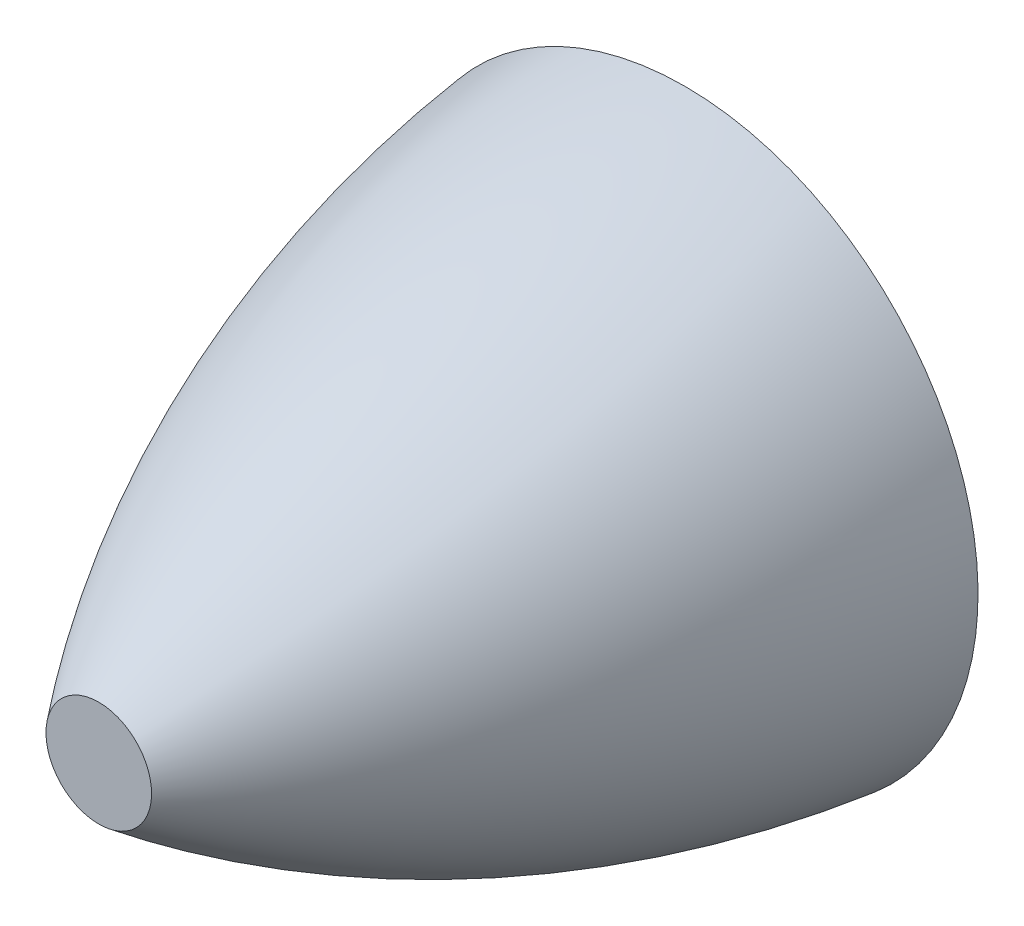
ISO-10303-21;
HEADER;
FILE_DESCRIPTION(('STEP AP214'),'2;1');
FILE_NAME('part.step','',(''),(''),'','','');
FILE_SCHEMA(('AUTOMOTIVE_DESIGN { 1 0 10303 214 1 1 1 1 }'));
ENDSEC;
DATA;
#1=APPLICATION_CONTEXT('core data for automotive mechanical design processes');
#2=APPLICATION_PROTOCOL_DEFINITION('international standard','automotive_design',2000,#1);
#3=PRODUCT_CONTEXT('',#1,'mechanical');
#4=PRODUCT('Part','Part','',(#3));
#5=PRODUCT_RELATED_PRODUCT_CATEGORY('part','',(#4));
#6=PRODUCT_DEFINITION_FORMATION('','',#4);
#7=PRODUCT_DEFINITION_CONTEXT('part definition',#1,'design');
#8=PRODUCT_DEFINITION('design','',#6,#7);
#9=PRODUCT_DEFINITION_SHAPE('','',#8);
#10=(LENGTH_UNIT() NAMED_UNIT(*) SI_UNIT(.MILLI.,.METRE.));
#11=(NAMED_UNIT(*) PLANE_ANGLE_UNIT() SI_UNIT($,.RADIAN.));
#12=(NAMED_UNIT(*) SI_UNIT($,.STERADIAN.) SOLID_ANGLE_UNIT());
#13=UNCERTAINTY_MEASURE_WITH_UNIT(LENGTH_MEASURE(1.E-05),#10,'distance_accuracy_value','');
#14=(GEOMETRIC_REPRESENTATION_CONTEXT(3) GLOBAL_UNCERTAINTY_ASSIGNED_CONTEXT((#13)) GLOBAL_UNIT_ASSIGNED_CONTEXT((#10,
#11,#12)) REPRESENTATION_CONTEXT('',''));
#15=CARTESIAN_POINT('',(0.,0.,0.));
#16=DIRECTION('',(0.,0.,1.));
#17=DIRECTION('',(1.,0.,0.));
#18=AXIS2_PLACEMENT_3D('',#15,#16,#17);
#19=CARTESIAN_POINT('',(0.,0.,8.));
#20=DIRECTION('',(0.,0.,-1.));
#21=DIRECTION('',(-1.,0.,0.));
#22=AXIS2_PLACEMENT_3D('',#19,#20,#21);
#23=PLANE('',#22);
#24=CARTESIAN_POINT('',(0.,0.,8.));
#25=DIRECTION('',(0.,0.,-1.));
#26=DIRECTION('',(-1.,0.,0.));
#27=AXIS2_PLACEMENT_3D('',#24,#25,#26);
#28=CIRCLE('',#27,4.);
#29=CARTESIAN_POINT('',(-4.,0.,8.));
#30=VERTEX_POINT('',#29);
#31=EDGE_CURVE('E27',#30,#30,#28,.T.);
#32=ORIENTED_EDGE('',*,*,#31,.T.);
#33=EDGE_LOOP('',(#32));
#34=FACE_BOUND('',#33,.T.);
#35=ADVANCED_FACE('F12',(#34),#23,.T.);
#36=CARTESIAN_POINT('',(0.,0.,30.));
#37=DIRECTION('',(0.,0.,-1.));
#38=DIRECTION('',(0.,1.,0.));
#39=AXIS2_PLACEMENT_3D('',#36,#37,#38);
#40=PLANE('',#39);
#41=CARTESIAN_POINT('',(0.,0.,30.));
#42=DIRECTION('',(0.,0.,-1.));
#43=DIRECTION('',(0.,1.,0.));
#44=AXIS2_PLACEMENT_3D('',#41,#42,#43);
#45=CIRCLE('',#44,2.7027027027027);
#46=CARTESIAN_POINT('',(0.,2.7027027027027,30.));
#47=VERTEX_POINT('',#46);
#48=EDGE_CURVE('E8',#47,#47,#45,.T.);
#49=ORIENTED_EDGE('',*,*,#48,.F.);
#50=EDGE_LOOP('',(#49));
#51=FACE_BOUND('',#50,.T.);
#52=ADVANCED_FACE('F14',(#51),#40,.F.);
#53=CARTESIAN_POINT('',(0.,0.,-6.91052948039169));
#54=DIRECTION('',(0.,0.,-1.));
#55=DIRECTION('',(0.,1.,0.));
#56=AXIS2_PLACEMENT_3D('',#53,#54,#55);
#57=DEGENERATE_TOROIDAL_SURFACE('',#56,44.600709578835,60.,.F.);
#58=ORIENTED_EDGE('',*,*,#48,.T.);
#59=EDGE_LOOP('',(#58));
#60=FACE_BOUND('',#59,.T.);
#61=CARTESIAN_POINT('',(0.,0.,0.));
#62=DIRECTION('',(0.,0.,-1.));
#63=DIRECTION('',(0.,1.,0.));
#64=AXIS2_PLACEMENT_3D('',#61,#62,#63);
#65=CIRCLE('',#64,15.);
#66=CARTESIAN_POINT('',(0.,15.,0.));
#67=VERTEX_POINT('',#66);
#68=EDGE_CURVE('E19',#67,#67,#65,.T.);
#69=ORIENTED_EDGE('',*,*,#68,.F.);
#70=EDGE_LOOP('',(#69));
#71=FACE_BOUND('',#70,.T.);
#72=ADVANCED_FACE('F43',(#60,#71),#57,.F.);
#73=CARTESIAN_POINT('',(15.,0.,0.));
#74=DIRECTION('',(0.,0.,1.));
#75=DIRECTION('',(0.,-1.,0.));
#76=AXIS2_PLACEMENT_3D('',#73,#74,#75);
#77=PLANE('',#76);
#78=CARTESIAN_POINT('',(0.,0.,0.));
#79=DIRECTION('',(0.,0.,-1.));
#80=DIRECTION('',(0.,1.,0.));
#81=AXIS2_PLACEMENT_3D('',#78,#79,#80);
#82=CIRCLE('',#81,4.);
#83=CARTESIAN_POINT('',(0.,4.,0.));
#84=VERTEX_POINT('',#83);
#85=EDGE_CURVE('E23',#84,#84,#82,.T.);
#86=ORIENTED_EDGE('',*,*,#85,.F.);
#87=EDGE_LOOP('',(#86));
#88=FACE_BOUND('',#87,.T.);
#89=ORIENTED_EDGE('',*,*,#68,.T.);
#90=EDGE_LOOP('',(#89));
#91=FACE_BOUND('',#90,.T.);
#92=ADVANCED_FACE('F36',(#88,#91),#77,.F.);
#93=CARTESIAN_POINT('',(0.,0.,8.));
#94=DIRECTION('',(0.,0.,-1.));
#95=DIRECTION('',(0.,1.,0.));
#96=AXIS2_PLACEMENT_3D('',#93,#94,#95);
#97=CYLINDRICAL_SURFACE('',#96,4.);
#98=ORIENTED_EDGE('',*,*,#85,.T.);
#99=EDGE_LOOP('',(#98));
#100=FACE_BOUND('',#99,.T.);
#101=ORIENTED_EDGE('',*,*,#31,.F.);
#102=EDGE_LOOP('',(#101));
#103=FACE_BOUND('',#102,.T.);
#104=ADVANCED_FACE('F34',(#100,#103),#97,.F.);
#105=CLOSED_SHELL('',(#35,#52,#72,#92,#104));
#106=MANIFOLD_SOLID_BREP('B1',#105);
#107=ADVANCED_BREP_SHAPE_REPRESENTATION('',(#18,#106),#14);
#108=SHAPE_DEFINITION_REPRESENTATION(#9,#107);
ENDSEC;
END-ISO-10303-21;
